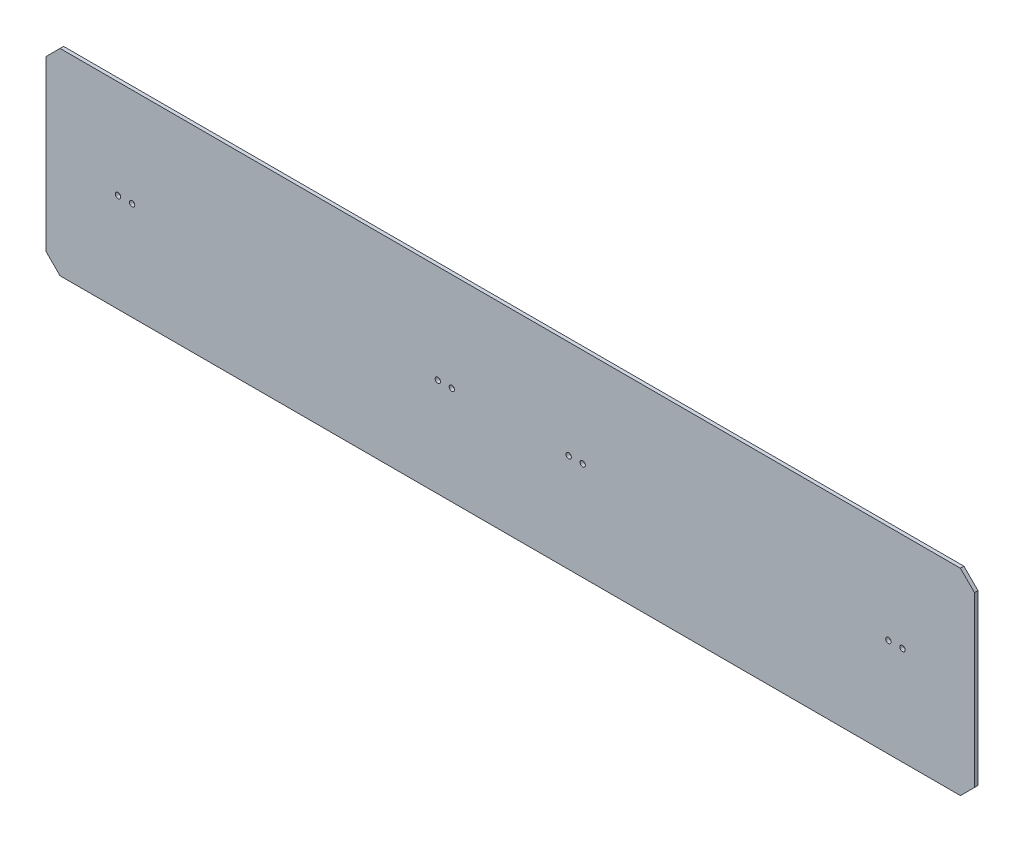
ISO-10303-21;
HEADER;
FILE_DESCRIPTION(('STEP AP214'),'2;1');
FILE_NAME('part.step','',(''),(''),'','','');
FILE_SCHEMA(('AUTOMOTIVE_DESIGN { 1 0 10303 214 1 1 1 1 }'));
ENDSEC;
DATA;
#1=APPLICATION_CONTEXT('core data for automotive mechanical design processes');
#2=APPLICATION_PROTOCOL_DEFINITION('international standard','automotive_design',2000,#1);
#3=PRODUCT_CONTEXT('',#1,'mechanical');
#4=PRODUCT('Part','Part','',(#3));
#5=PRODUCT_RELATED_PRODUCT_CATEGORY('part','',(#4));
#6=PRODUCT_DEFINITION_FORMATION('','',#4);
#7=PRODUCT_DEFINITION_CONTEXT('part definition',#1,'design');
#8=PRODUCT_DEFINITION('design','',#6,#7);
#9=PRODUCT_DEFINITION_SHAPE('','',#8);
#10=(LENGTH_UNIT() NAMED_UNIT(*) SI_UNIT(.MILLI.,.METRE.));
#11=(NAMED_UNIT(*) PLANE_ANGLE_UNIT() SI_UNIT($,.RADIAN.));
#12=(NAMED_UNIT(*) SI_UNIT($,.STERADIAN.) SOLID_ANGLE_UNIT());
#13=UNCERTAINTY_MEASURE_WITH_UNIT(LENGTH_MEASURE(1.E-05),#10,'distance_accuracy_value','');
#14=(GEOMETRIC_REPRESENTATION_CONTEXT(3) GLOBAL_UNCERTAINTY_ASSIGNED_CONTEXT((#13)) GLOBAL_UNIT_ASSIGNED_CONTEXT((#10,
#11,#12)) REPRESENTATION_CONTEXT('',''));
#15=CARTESIAN_POINT('',(0.,0.,0.));
#16=DIRECTION('',(0.,0.,1.));
#17=DIRECTION('',(1.,0.,0.));
#18=AXIS2_PLACEMENT_3D('',#15,#16,#17);
#19=CARTESIAN_POINT('',(-165.591471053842,343.129564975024,6.35));
#20=DIRECTION('',(1.,0.,0.));
#21=DIRECTION('',(0.,1.,0.));
#22=AXIS2_PLACEMENT_3D('',#19,#20,#21);
#23=PLANE('',#22);
#24=DIRECTION('',(0.,-1.,0.));
#25=VECTOR('',#24,1.);
#26=CARTESIAN_POINT('',(-165.591471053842,343.129564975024,0.));
#27=LINE('',#26,#25);
#28=CARTESIAN_POINT('',(-165.591471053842,317.729564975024,0.));
#29=VERTEX_POINT('',#28);
#30=CARTESIAN_POINT('',(-165.591471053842,12.929564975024,0.));
#31=VERTEX_POINT('',#30);
#32=EDGE_CURVE('E127',#29,#31,#27,.T.);
#33=ORIENTED_EDGE('',*,*,#32,.T.);
#34=DIRECTION('',(0.,0.,1.));
#35=VECTOR('',#34,1.);
#36=CARTESIAN_POINT('',(-165.591471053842,12.929564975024,6.35));
#37=LINE('',#36,#35);
#38=CARTESIAN_POINT('',(-165.591471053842,12.9295649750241,6.35));
#39=VERTEX_POINT('',#38);
#40=EDGE_CURVE('E11',#31,#39,#37,.T.);
#41=ORIENTED_EDGE('',*,*,#40,.T.);
#42=DIRECTION('',(0.,-1.,0.));
#43=VECTOR('',#42,1.);
#44=CARTESIAN_POINT('',(-165.591471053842,343.129564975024,6.35));
#45=LINE('',#44,#43);
#46=CARTESIAN_POINT('',(-165.591471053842,317.729564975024,6.35));
#47=VERTEX_POINT('',#46);
#48=EDGE_CURVE('E125',#47,#39,#45,.T.);
#49=ORIENTED_EDGE('',*,*,#48,.F.);
#50=DIRECTION('',(0.,0.,-1.));
#51=VECTOR('',#50,1.);
#52=CARTESIAN_POINT('',(-165.591471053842,317.729564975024,6.35));
#53=LINE('',#52,#51);
#54=EDGE_CURVE('E39',#47,#29,#53,.T.);
#55=ORIENTED_EDGE('',*,*,#54,.T.);
#56=EDGE_LOOP('',(#33,#41,#49,#55));
#57=FACE_BOUND('',#56,.T.);
#58=ADVANCED_FACE('F32',(#57),#23,.F.);
#59=CARTESIAN_POINT('',(-165.591471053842,-12.4704350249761,6.35));
#60=DIRECTION('',(0.,1.,0.));
#61=DIRECTION('',(0.,0.,1.));
#62=AXIS2_PLACEMENT_3D('',#59,#60,#61);
#63=PLANE('',#62);
#64=DIRECTION('',(1.,0.,0.));
#65=VECTOR('',#64,1.);
#66=CARTESIAN_POINT('',(-165.591471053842,-12.4704350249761,0.));
#67=LINE('',#66,#65);
#68=CARTESIAN_POINT('',(-140.191471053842,-12.4704350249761,0.));
#69=VERTEX_POINT('',#68);
#70=CARTESIAN_POINT('',(1485.40852894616,-12.4704350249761,0.));
#71=VERTEX_POINT('',#70);
#72=EDGE_CURVE('E123',#69,#71,#67,.T.);
#73=ORIENTED_EDGE('',*,*,#72,.T.);
#74=DIRECTION('',(0.,0.,1.));
#75=VECTOR('',#74,1.);
#76=CARTESIAN_POINT('',(1485.40852894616,-12.4704350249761,6.35));
#77=LINE('',#76,#75);
#78=CARTESIAN_POINT('',(1485.40852894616,-12.470435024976,6.35));
#79=VERTEX_POINT('',#78);
#80=EDGE_CURVE('E102',#71,#79,#77,.T.);
#81=ORIENTED_EDGE('',*,*,#80,.T.);
#82=DIRECTION('',(1.,0.,0.));
#83=VECTOR('',#82,1.);
#84=CARTESIAN_POINT('',(-165.591471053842,-12.4704350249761,6.35));
#85=LINE('',#84,#83);
#86=CARTESIAN_POINT('',(-140.191471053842,-12.4704350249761,6.35));
#87=VERTEX_POINT('',#86);
#88=EDGE_CURVE('E133',#87,#79,#85,.T.);
#89=ORIENTED_EDGE('',*,*,#88,.F.);
#90=DIRECTION('',(0.,0.,-1.));
#91=VECTOR('',#90,1.);
#92=CARTESIAN_POINT('',(-140.191471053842,-12.4704350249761,6.35));
#93=LINE('',#92,#91);
#94=EDGE_CURVE('E107',#87,#69,#93,.T.);
#95=ORIENTED_EDGE('',*,*,#94,.T.);
#96=EDGE_LOOP('',(#73,#81,#89,#95));
#97=FACE_BOUND('',#96,.T.);
#98=ADVANCED_FACE('F253',(#97),#63,.F.);
#99=CARTESIAN_POINT('',(1510.80852894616,343.129564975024,6.35));
#100=DIRECTION('',(-1.,0.,0.));
#101=DIRECTION('',(0.,0.,1.));
#102=AXIS2_PLACEMENT_3D('',#99,#100,#101);
#103=PLANE('',#102);
#104=DIRECTION('',(0.,1.,0.));
#105=VECTOR('',#104,1.);
#106=CARTESIAN_POINT('',(1510.80852894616,343.129564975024,6.35));
#107=LINE('',#106,#105);
#108=CARTESIAN_POINT('',(1510.80852894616,12.9295649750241,6.35));
#109=VERTEX_POINT('',#108);
#110=CARTESIAN_POINT('',(1510.80852894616,317.729564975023,6.35));
#111=VERTEX_POINT('',#110);
#112=EDGE_CURVE('E116',#109,#111,#107,.T.);
#113=ORIENTED_EDGE('',*,*,#112,.F.);
#114=DIRECTION('',(0.,0.,-1.));
#115=VECTOR('',#114,1.);
#116=CARTESIAN_POINT('',(1510.80852894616,12.9295649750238,6.35));
#117=LINE('',#116,#115);
#118=CARTESIAN_POINT('',(1510.80852894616,12.9295649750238,0.));
#119=VERTEX_POINT('',#118);
#120=EDGE_CURVE('E101',#109,#119,#117,.T.);
#121=ORIENTED_EDGE('',*,*,#120,.T.);
#122=DIRECTION('',(0.,1.,0.));
#123=VECTOR('',#122,1.);
#124=CARTESIAN_POINT('',(1510.80852894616,343.129564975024,0.));
#125=LINE('',#124,#123);
#126=CARTESIAN_POINT('',(1510.80852894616,317.729564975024,0.));
#127=VERTEX_POINT('',#126);
#128=EDGE_CURVE('E114',#119,#127,#125,.T.);
#129=ORIENTED_EDGE('',*,*,#128,.T.);
#130=DIRECTION('',(0.,0.,1.));
#131=VECTOR('',#130,1.);
#132=CARTESIAN_POINT('',(1510.80852894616,317.729564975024,6.35));
#133=LINE('',#132,#131);
#134=EDGE_CURVE('E118',#127,#111,#133,.T.);
#135=ORIENTED_EDGE('',*,*,#134,.T.);
#136=EDGE_LOOP('',(#113,#121,#129,#135));
#137=FACE_BOUND('',#136,.T.);
#138=ADVANCED_FACE('F113',(#137),#103,.F.);
#139=CARTESIAN_POINT('',(-165.591471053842,343.129564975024,6.35));
#140=DIRECTION('',(0.,-1.,0.));
#141=DIRECTION('',(1.,0.,0.));
#142=AXIS2_PLACEMENT_3D('',#139,#140,#141);
#143=PLANE('',#142);
#144=DIRECTION('',(-1.,0.,0.));
#145=VECTOR('',#144,1.);
#146=CARTESIAN_POINT('',(-165.591471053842,343.129564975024,6.35));
#147=LINE('',#146,#145);
#148=CARTESIAN_POINT('',(1485.40852894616,343.129564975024,6.35));
#149=VERTEX_POINT('',#148);
#150=CARTESIAN_POINT('',(-140.191471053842,343.129564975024,6.35));
#151=VERTEX_POINT('',#150);
#152=EDGE_CURVE('E137',#149,#151,#147,.T.);
#153=ORIENTED_EDGE('',*,*,#152,.F.);
#154=DIRECTION('',(0.,0.,-1.));
#155=VECTOR('',#154,1.);
#156=CARTESIAN_POINT('',(1485.40852894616,343.129564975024,6.35));
#157=LINE('',#156,#155);
#158=CARTESIAN_POINT('',(1485.40852894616,343.129564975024,0.));
#159=VERTEX_POINT('',#158);
#160=EDGE_CURVE('E155',#149,#159,#157,.T.);
#161=ORIENTED_EDGE('',*,*,#160,.T.);
#162=DIRECTION('',(-1.,0.,0.));
#163=VECTOR('',#162,1.);
#164=CARTESIAN_POINT('',(-165.591471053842,343.129564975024,0.));
#165=LINE('',#164,#163);
#166=CARTESIAN_POINT('',(-140.191471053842,343.129564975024,0.));
#167=VERTEX_POINT('',#166);
#168=EDGE_CURVE('E122',#159,#167,#165,.T.);
#169=ORIENTED_EDGE('',*,*,#168,.T.);
#170=DIRECTION('',(0.,0.,1.));
#171=VECTOR('',#170,1.);
#172=CARTESIAN_POINT('',(-140.191471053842,343.129564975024,6.35));
#173=LINE('',#172,#171);
#174=EDGE_CURVE('E46',#167,#151,#173,.T.);
#175=ORIENTED_EDGE('',*,*,#174,.T.);
#176=EDGE_LOOP('',(#153,#161,#169,#175));
#177=FACE_BOUND('',#176,.T.);
#178=ADVANCED_FACE('F261',(#177),#143,.F.);
#179=CARTESIAN_POINT('',(-165.591471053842,-12.4704350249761,6.35));
#180=DIRECTION('',(0.,0.,1.));
#181=DIRECTION('',(1.,0.,0.));
#182=AXIS2_PLACEMENT_3D('',#179,#180,#181);
#183=PLANE('',#182);
#184=CARTESIAN_POINT('',(-10.1434710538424,165.329564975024,6.35));
#185=DIRECTION('',(0.,0.,-1.));
#186=DIRECTION('',(-1.,0.,0.));
#187=AXIS2_PLACEMENT_3D('',#184,#185,#186);
#188=CIRCLE('',#187,4.82599999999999);
#189=CARTESIAN_POINT('',(-14.9694710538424,165.329564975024,6.35));
#190=VERTEX_POINT('',#189);
#191=EDGE_CURVE('E209',#190,#190,#188,.T.);
#192=ORIENTED_EDGE('',*,*,#191,.T.);
#193=EDGE_LOOP('',(#192));
#194=FACE_BOUND('',#193,.T.);
#195=CARTESIAN_POINT('',(-35.5434710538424,165.329564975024,6.35));
#196=DIRECTION('',(0.,0.,-1.));
#197=DIRECTION('',(-1.,0.,0.));
#198=AXIS2_PLACEMENT_3D('',#195,#196,#197);
#199=CIRCLE('',#198,4.82599999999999);
#200=CARTESIAN_POINT('',(-40.3694710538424,165.329564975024,6.35));
#201=VERTEX_POINT('',#200);
#202=EDGE_CURVE('E203',#201,#201,#199,.T.);
#203=ORIENTED_EDGE('',*,*,#202,.T.);
#204=EDGE_LOOP('',(#203));
#205=FACE_BOUND('',#204,.T.);
#206=CARTESIAN_POINT('',(541.798528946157,165.329564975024,6.35));
#207=DIRECTION('',(0.,0.,-1.));
#208=DIRECTION('',(-1.,0.,0.));
#209=AXIS2_PLACEMENT_3D('',#206,#207,#208);
#210=CIRCLE('',#209,4.82599999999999);
#211=CARTESIAN_POINT('',(536.972528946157,165.329564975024,6.35));
#212=VERTEX_POINT('',#211);
#213=EDGE_CURVE('E197',#212,#212,#210,.T.);
#214=ORIENTED_EDGE('',*,*,#213,.T.);
#215=EDGE_LOOP('',(#214));
#216=FACE_BOUND('',#215,.T.);
#217=CARTESIAN_POINT('',(567.198528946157,165.329564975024,6.35));
#218=DIRECTION('',(0.,0.,-1.));
#219=DIRECTION('',(-1.,0.,0.));
#220=AXIS2_PLACEMENT_3D('',#217,#218,#219);
#221=CIRCLE('',#220,4.82599999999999);
#222=CARTESIAN_POINT('',(562.372528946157,165.329564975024,6.35));
#223=VERTEX_POINT('',#222);
#224=EDGE_CURVE('E191',#223,#223,#221,.T.);
#225=ORIENTED_EDGE('',*,*,#224,.T.);
#226=EDGE_LOOP('',(#225));
#227=FACE_BOUND('',#226,.T.);
#228=CARTESIAN_POINT('',(778.018528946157,165.329564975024,6.35));
#229=DIRECTION('',(0.,0.,-1.));
#230=DIRECTION('',(-1.,0.,0.));
#231=AXIS2_PLACEMENT_3D('',#228,#229,#230);
#232=CIRCLE('',#231,4.82599999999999);
#233=CARTESIAN_POINT('',(773.192528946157,165.329564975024,6.35));
#234=VERTEX_POINT('',#233);
#235=EDGE_CURVE('E185',#234,#234,#232,.T.);
#236=ORIENTED_EDGE('',*,*,#235,.T.);
#237=EDGE_LOOP('',(#236));
#238=FACE_BOUND('',#237,.T.);
#239=CARTESIAN_POINT('',(803.418528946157,165.329564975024,6.35));
#240=DIRECTION('',(0.,0.,-1.));
#241=DIRECTION('',(-1.,0.,0.));
#242=AXIS2_PLACEMENT_3D('',#239,#240,#241);
#243=CIRCLE('',#242,4.82599999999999);
#244=CARTESIAN_POINT('',(798.592528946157,165.329564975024,6.35));
#245=VERTEX_POINT('',#244);
#246=EDGE_CURVE('E179',#245,#245,#243,.T.);
#247=ORIENTED_EDGE('',*,*,#246,.T.);
#248=EDGE_LOOP('',(#247));
#249=FACE_BOUND('',#248,.T.);
#250=CARTESIAN_POINT('',(1355.36052894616,165.329564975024,6.35));
#251=DIRECTION('',(0.,0.,-1.));
#252=DIRECTION('',(-1.,0.,0.));
#253=AXIS2_PLACEMENT_3D('',#250,#251,#252);
#254=CIRCLE('',#253,4.82599999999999);
#255=CARTESIAN_POINT('',(1350.53452894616,165.329564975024,6.35));
#256=VERTEX_POINT('',#255);
#257=EDGE_CURVE('E173',#256,#256,#254,.T.);
#258=ORIENTED_EDGE('',*,*,#257,.T.);
#259=EDGE_LOOP('',(#258));
#260=FACE_BOUND('',#259,.T.);
#261=CARTESIAN_POINT('',(1380.76052894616,165.329564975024,6.35));
#262=DIRECTION('',(0.,0.,-1.));
#263=DIRECTION('',(-1.,0.,0.));
#264=AXIS2_PLACEMENT_3D('',#261,#262,#263);
#265=CIRCLE('',#264,4.82599999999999);
#266=CARTESIAN_POINT('',(1375.93452894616,165.329564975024,6.35));
#267=VERTEX_POINT('',#266);
#268=EDGE_CURVE('E166',#267,#267,#265,.T.);
#269=ORIENTED_EDGE('',*,*,#268,.T.);
#270=EDGE_LOOP('',(#269));
#271=FACE_BOUND('',#270,.T.);
#272=ORIENTED_EDGE('',*,*,#88,.T.);
#273=DIRECTION('',(-0.707106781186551,-0.707106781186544,0.));
#274=VECTOR('',#273,1.);
#275=CARTESIAN_POINT('',(659.90852894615,-837.970435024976,6.35));
#276=LINE('',#275,#274);
#277=EDGE_CURVE('E152',#79,#109,#276,.F.);
#278=ORIENTED_EDGE('',*,*,#277,.T.);
#279=ORIENTED_EDGE('',*,*,#112,.T.);
#280=DIRECTION('',(0.707106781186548,-0.707106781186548,0.));
#281=VECTOR('',#280,1.);
#282=CARTESIAN_POINT('',(837.708528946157,990.829564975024,6.35));
#283=LINE('',#282,#281);
#284=EDGE_CURVE('E53',#111,#149,#283,.F.);
#285=ORIENTED_EDGE('',*,*,#284,.T.);
#286=ORIENTED_EDGE('',*,*,#152,.T.);
#287=DIRECTION('',(0.707106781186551,0.707106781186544,0.));
#288=VECTOR('',#287,1.);
#289=CARTESIAN_POINT('',(-330.691471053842,152.629564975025,6.35));
#290=LINE('',#289,#288);
#291=EDGE_CURVE('E147',#151,#47,#290,.F.);
#292=ORIENTED_EDGE('',*,*,#291,.T.);
#293=ORIENTED_EDGE('',*,*,#48,.T.);
#294=DIRECTION('',(-0.707106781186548,0.707106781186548,0.));
#295=VECTOR('',#294,1.);
#296=CARTESIAN_POINT('',(-152.891471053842,0.229564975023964,6.35));
#297=LINE('',#296,#295);
#298=EDGE_CURVE('E149',#39,#87,#297,.F.);
#299=ORIENTED_EDGE('',*,*,#298,.T.);
#300=EDGE_LOOP('',(#272,#278,#279,#285,#286,#292,#293,#299));
#301=FACE_BOUND('',#300,.T.);
#302=ADVANCED_FACE('F220',(#194,#205,#216,#227,#238,#249,#260,#271,#301),#183,.T.);
#303=CARTESIAN_POINT('',(-165.591471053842,-12.4704350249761,0.));
#304=DIRECTION('',(0.,0.,1.));
#305=DIRECTION('',(1.,0.,0.));
#306=AXIS2_PLACEMENT_3D('',#303,#304,#305);
#307=PLANE('',#306);
#308=CARTESIAN_POINT('',(-10.1434710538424,165.329564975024,0.));
#309=DIRECTION('',(0.,0.,-1.));
#310=DIRECTION('',(-1.,0.,0.));
#311=AXIS2_PLACEMENT_3D('',#308,#309,#310);
#312=CIRCLE('',#311,4.82599999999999);
#313=CARTESIAN_POINT('',(-14.9694710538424,165.329564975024,0.));
#314=VERTEX_POINT('',#313);
#315=EDGE_CURVE('E212',#314,#314,#312,.T.);
#316=ORIENTED_EDGE('',*,*,#315,.F.);
#317=EDGE_LOOP('',(#316));
#318=FACE_BOUND('',#317,.T.);
#319=CARTESIAN_POINT('',(-35.5434710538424,165.329564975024,0.));
#320=DIRECTION('',(0.,0.,-1.));
#321=DIRECTION('',(-1.,0.,0.));
#322=AXIS2_PLACEMENT_3D('',#319,#320,#321);
#323=CIRCLE('',#322,4.82599999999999);
#324=CARTESIAN_POINT('',(-40.3694710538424,165.329564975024,0.));
#325=VERTEX_POINT('',#324);
#326=EDGE_CURVE('E206',#325,#325,#323,.T.);
#327=ORIENTED_EDGE('',*,*,#326,.F.);
#328=EDGE_LOOP('',(#327));
#329=FACE_BOUND('',#328,.T.);
#330=CARTESIAN_POINT('',(541.798528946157,165.329564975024,0.));
#331=DIRECTION('',(0.,0.,-1.));
#332=DIRECTION('',(-1.,0.,0.));
#333=AXIS2_PLACEMENT_3D('',#330,#331,#332);
#334=CIRCLE('',#333,4.82599999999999);
#335=CARTESIAN_POINT('',(536.972528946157,165.329564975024,0.));
#336=VERTEX_POINT('',#335);
#337=EDGE_CURVE('E200',#336,#336,#334,.T.);
#338=ORIENTED_EDGE('',*,*,#337,.F.);
#339=EDGE_LOOP('',(#338));
#340=FACE_BOUND('',#339,.T.);
#341=CARTESIAN_POINT('',(567.198528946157,165.329564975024,0.));
#342=DIRECTION('',(0.,0.,-1.));
#343=DIRECTION('',(-1.,0.,0.));
#344=AXIS2_PLACEMENT_3D('',#341,#342,#343);
#345=CIRCLE('',#344,4.82599999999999);
#346=CARTESIAN_POINT('',(562.372528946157,165.329564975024,0.));
#347=VERTEX_POINT('',#346);
#348=EDGE_CURVE('E194',#347,#347,#345,.T.);
#349=ORIENTED_EDGE('',*,*,#348,.F.);
#350=EDGE_LOOP('',(#349));
#351=FACE_BOUND('',#350,.T.);
#352=CARTESIAN_POINT('',(778.018528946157,165.329564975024,0.));
#353=DIRECTION('',(0.,0.,-1.));
#354=DIRECTION('',(-1.,0.,0.));
#355=AXIS2_PLACEMENT_3D('',#352,#353,#354);
#356=CIRCLE('',#355,4.82599999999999);
#357=CARTESIAN_POINT('',(773.192528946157,165.329564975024,0.));
#358=VERTEX_POINT('',#357);
#359=EDGE_CURVE('E188',#358,#358,#356,.T.);
#360=ORIENTED_EDGE('',*,*,#359,.F.);
#361=EDGE_LOOP('',(#360));
#362=FACE_BOUND('',#361,.T.);
#363=CARTESIAN_POINT('',(803.418528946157,165.329564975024,0.));
#364=DIRECTION('',(0.,0.,-1.));
#365=DIRECTION('',(-1.,0.,0.));
#366=AXIS2_PLACEMENT_3D('',#363,#364,#365);
#367=CIRCLE('',#366,4.82599999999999);
#368=CARTESIAN_POINT('',(798.592528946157,165.329564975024,0.));
#369=VERTEX_POINT('',#368);
#370=EDGE_CURVE('E182',#369,#369,#367,.T.);
#371=ORIENTED_EDGE('',*,*,#370,.F.);
#372=EDGE_LOOP('',(#371));
#373=FACE_BOUND('',#372,.T.);
#374=CARTESIAN_POINT('',(1355.36052894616,165.329564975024,0.));
#375=DIRECTION('',(0.,0.,-1.));
#376=DIRECTION('',(-1.,0.,0.));
#377=AXIS2_PLACEMENT_3D('',#374,#375,#376);
#378=CIRCLE('',#377,4.82599999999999);
#379=CARTESIAN_POINT('',(1350.53452894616,165.329564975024,0.));
#380=VERTEX_POINT('',#379);
#381=EDGE_CURVE('E176',#380,#380,#378,.T.);
#382=ORIENTED_EDGE('',*,*,#381,.F.);
#383=EDGE_LOOP('',(#382));
#384=FACE_BOUND('',#383,.T.);
#385=CARTESIAN_POINT('',(1380.76052894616,165.329564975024,0.));
#386=DIRECTION('',(0.,0.,-1.));
#387=DIRECTION('',(-1.,0.,0.));
#388=AXIS2_PLACEMENT_3D('',#385,#386,#387);
#389=CIRCLE('',#388,4.82599999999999);
#390=CARTESIAN_POINT('',(1375.93452894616,165.329564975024,0.));
#391=VERTEX_POINT('',#390);
#392=EDGE_CURVE('E168',#391,#391,#389,.T.);
#393=ORIENTED_EDGE('',*,*,#392,.F.);
#394=EDGE_LOOP('',(#393));
#395=FACE_BOUND('',#394,.T.);
#396=ORIENTED_EDGE('',*,*,#128,.F.);
#397=DIRECTION('',(0.707106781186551,0.707106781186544,0.));
#398=VECTOR('',#397,1.);
#399=CARTESIAN_POINT('',(1510.80852894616,12.9295649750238,0.));
#400=LINE('',#399,#398);
#401=EDGE_CURVE('E97',#119,#71,#400,.F.);
#402=ORIENTED_EDGE('',*,*,#401,.T.);
#403=ORIENTED_EDGE('',*,*,#72,.F.);
#404=DIRECTION('',(0.707106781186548,-0.707106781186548,0.));
#405=VECTOR('',#404,1.);
#406=CARTESIAN_POINT('',(-140.191471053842,-12.4704350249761,0.));
#407=LINE('',#406,#405);
#408=EDGE_CURVE('E141',#69,#31,#407,.F.);
#409=ORIENTED_EDGE('',*,*,#408,.T.);
#410=ORIENTED_EDGE('',*,*,#32,.F.);
#411=DIRECTION('',(-0.707106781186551,-0.707106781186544,0.));
#412=VECTOR('',#411,1.);
#413=CARTESIAN_POINT('',(-165.591471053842,317.729564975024,0.));
#414=LINE('',#413,#412);
#415=EDGE_CURVE('E117',#29,#167,#414,.F.);
#416=ORIENTED_EDGE('',*,*,#415,.T.);
#417=ORIENTED_EDGE('',*,*,#168,.F.);
#418=DIRECTION('',(-0.707106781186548,0.707106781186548,0.));
#419=VECTOR('',#418,1.);
#420=CARTESIAN_POINT('',(1485.40852894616,343.129564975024,0.));
#421=LINE('',#420,#419);
#422=EDGE_CURVE('E108',#159,#127,#421,.F.);
#423=ORIENTED_EDGE('',*,*,#422,.T.);
#424=EDGE_LOOP('',(#396,#402,#403,#409,#410,#416,#417,#423));
#425=FACE_BOUND('',#424,.T.);
#426=ADVANCED_FACE('F120',(#318,#329,#340,#351,#362,#373,#384,#395,#425),#307,.F.);
#427=CARTESIAN_POINT('',(1510.80852894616,12.9295649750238,6.35));
#428=DIRECTION('',(-0.707106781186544,0.707106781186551,0.));
#429=DIRECTION('',(-0.707106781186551,-0.707106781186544,0.));
#430=AXIS2_PLACEMENT_3D('',#427,#428,#429);
#431=PLANE('',#430);
#432=ORIENTED_EDGE('',*,*,#277,.F.);
#433=ORIENTED_EDGE('',*,*,#80,.F.);
#434=ORIENTED_EDGE('',*,*,#401,.F.);
#435=ORIENTED_EDGE('',*,*,#120,.F.);
#436=EDGE_LOOP('',(#432,#433,#434,#435));
#437=FACE_BOUND('',#436,.T.);
#438=ADVANCED_FACE('F100',(#437),#431,.F.);
#439=CARTESIAN_POINT('',(1485.40852894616,343.129564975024,6.35));
#440=DIRECTION('',(-0.707106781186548,-0.707106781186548,0.));
#441=DIRECTION('',(0.707106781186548,-0.707106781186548,0.));
#442=AXIS2_PLACEMENT_3D('',#439,#440,#441);
#443=PLANE('',#442);
#444=ORIENTED_EDGE('',*,*,#284,.F.);
#445=ORIENTED_EDGE('',*,*,#134,.F.);
#446=ORIENTED_EDGE('',*,*,#422,.F.);
#447=ORIENTED_EDGE('',*,*,#160,.F.);
#448=EDGE_LOOP('',(#444,#445,#446,#447));
#449=FACE_BOUND('',#448,.T.);
#450=ADVANCED_FACE('F271',(#449),#443,.F.);
#451=CARTESIAN_POINT('',(-140.191471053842,-12.4704350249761,6.35));
#452=DIRECTION('',(0.707106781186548,0.707106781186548,0.));
#453=DIRECTION('',(-0.707106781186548,0.707106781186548,0.));
#454=AXIS2_PLACEMENT_3D('',#451,#452,#453);
#455=PLANE('',#454);
#456=ORIENTED_EDGE('',*,*,#298,.F.);
#457=ORIENTED_EDGE('',*,*,#40,.F.);
#458=ORIENTED_EDGE('',*,*,#408,.F.);
#459=ORIENTED_EDGE('',*,*,#94,.F.);
#460=EDGE_LOOP('',(#456,#457,#458,#459));
#461=FACE_BOUND('',#460,.T.);
#462=ADVANCED_FACE('F249',(#461),#455,.F.);
#463=CARTESIAN_POINT('',(-165.591471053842,317.729564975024,6.35));
#464=DIRECTION('',(0.707106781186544,-0.707106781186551,0.));
#465=DIRECTION('',(0.707106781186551,0.707106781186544,0.));
#466=AXIS2_PLACEMENT_3D('',#463,#464,#465);
#467=PLANE('',#466);
#468=ORIENTED_EDGE('',*,*,#291,.F.);
#469=ORIENTED_EDGE('',*,*,#174,.F.);
#470=ORIENTED_EDGE('',*,*,#415,.F.);
#471=ORIENTED_EDGE('',*,*,#54,.F.);
#472=EDGE_LOOP('',(#468,#469,#470,#471));
#473=FACE_BOUND('',#472,.T.);
#474=ADVANCED_FACE('F239',(#473),#467,.F.);
#475=CARTESIAN_POINT('',(1380.76052894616,165.329564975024,6.35));
#476=DIRECTION('',(0.,0.,-1.));
#477=DIRECTION('',(-1.,0.,0.));
#478=AXIS2_PLACEMENT_3D('',#475,#476,#477);
#479=CYLINDRICAL_SURFACE('',#478,4.82599999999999);
#480=ORIENTED_EDGE('',*,*,#268,.F.);
#481=EDGE_LOOP('',(#480));
#482=FACE_BOUND('',#481,.T.);
#483=ORIENTED_EDGE('',*,*,#392,.T.);
#484=EDGE_LOOP('',(#483));
#485=FACE_BOUND('',#484,.T.);
#486=ADVANCED_FACE('F236',(#482,#485),#479,.F.);
#487=CARTESIAN_POINT('',(1355.36052894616,165.329564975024,6.35));
#488=DIRECTION('',(0.,0.,-1.));
#489=DIRECTION('',(-1.,0.,0.));
#490=AXIS2_PLACEMENT_3D('',#487,#488,#489);
#491=CYLINDRICAL_SURFACE('',#490,4.82599999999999);
#492=ORIENTED_EDGE('',*,*,#257,.F.);
#493=EDGE_LOOP('',(#492));
#494=FACE_BOUND('',#493,.T.);
#495=ORIENTED_EDGE('',*,*,#381,.T.);
#496=EDGE_LOOP('',(#495));
#497=FACE_BOUND('',#496,.T.);
#498=ADVANCED_FACE('F238',(#494,#497),#491,.F.);
#499=CARTESIAN_POINT('',(803.418528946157,165.329564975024,6.35));
#500=DIRECTION('',(0.,0.,-1.));
#501=DIRECTION('',(-1.,0.,0.));
#502=AXIS2_PLACEMENT_3D('',#499,#500,#501);
#503=CYLINDRICAL_SURFACE('',#502,4.82599999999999);
#504=ORIENTED_EDGE('',*,*,#246,.F.);
#505=EDGE_LOOP('',(#504));
#506=FACE_BOUND('',#505,.T.);
#507=ORIENTED_EDGE('',*,*,#370,.T.);
#508=EDGE_LOOP('',(#507));
#509=FACE_BOUND('',#508,.T.);
#510=ADVANCED_FACE('F246',(#506,#509),#503,.F.);
#511=CARTESIAN_POINT('',(778.018528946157,165.329564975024,6.35));
#512=DIRECTION('',(0.,0.,-1.));
#513=DIRECTION('',(-1.,0.,0.));
#514=AXIS2_PLACEMENT_3D('',#511,#512,#513);
#515=CYLINDRICAL_SURFACE('',#514,4.82599999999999);
#516=ORIENTED_EDGE('',*,*,#235,.F.);
#517=EDGE_LOOP('',(#516));
#518=FACE_BOUND('',#517,.T.);
#519=ORIENTED_EDGE('',*,*,#359,.T.);
#520=EDGE_LOOP('',(#519));
#521=FACE_BOUND('',#520,.T.);
#522=ADVANCED_FACE('F322',(#518,#521),#515,.F.);
#523=CARTESIAN_POINT('',(567.198528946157,165.329564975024,6.35));
#524=DIRECTION('',(0.,0.,-1.));
#525=DIRECTION('',(-1.,0.,0.));
#526=AXIS2_PLACEMENT_3D('',#523,#524,#525);
#527=CYLINDRICAL_SURFACE('',#526,4.82599999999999);
#528=ORIENTED_EDGE('',*,*,#224,.F.);
#529=EDGE_LOOP('',(#528));
#530=FACE_BOUND('',#529,.T.);
#531=ORIENTED_EDGE('',*,*,#348,.T.);
#532=EDGE_LOOP('',(#531));
#533=FACE_BOUND('',#532,.T.);
#534=ADVANCED_FACE('F332',(#530,#533),#527,.F.);
#535=CARTESIAN_POINT('',(541.798528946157,165.329564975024,6.35));
#536=DIRECTION('',(0.,0.,-1.));
#537=DIRECTION('',(-1.,0.,0.));
#538=AXIS2_PLACEMENT_3D('',#535,#536,#537);
#539=CYLINDRICAL_SURFACE('',#538,4.82599999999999);
#540=ORIENTED_EDGE('',*,*,#213,.F.);
#541=EDGE_LOOP('',(#540));
#542=FACE_BOUND('',#541,.T.);
#543=ORIENTED_EDGE('',*,*,#337,.T.);
#544=EDGE_LOOP('',(#543));
#545=FACE_BOUND('',#544,.T.);
#546=ADVANCED_FACE('F342',(#542,#545),#539,.F.);
#547=CARTESIAN_POINT('',(-35.5434710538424,165.329564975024,6.35));
#548=DIRECTION('',(0.,0.,-1.));
#549=DIRECTION('',(-1.,0.,0.));
#550=AXIS2_PLACEMENT_3D('',#547,#548,#549);
#551=CYLINDRICAL_SURFACE('',#550,4.82599999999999);
#552=ORIENTED_EDGE('',*,*,#202,.F.);
#553=EDGE_LOOP('',(#552));
#554=FACE_BOUND('',#553,.T.);
#555=ORIENTED_EDGE('',*,*,#326,.T.);
#556=EDGE_LOOP('',(#555));
#557=FACE_BOUND('',#556,.T.);
#558=ADVANCED_FACE('F352',(#554,#557),#551,.F.);
#559=CARTESIAN_POINT('',(-10.1434710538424,165.329564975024,6.35));
#560=DIRECTION('',(0.,0.,-1.));
#561=DIRECTION('',(-1.,0.,0.));
#562=AXIS2_PLACEMENT_3D('',#559,#560,#561);
#563=CYLINDRICAL_SURFACE('',#562,4.82599999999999);
#564=ORIENTED_EDGE('',*,*,#191,.F.);
#565=EDGE_LOOP('',(#564));
#566=FACE_BOUND('',#565,.T.);
#567=ORIENTED_EDGE('',*,*,#315,.T.);
#568=EDGE_LOOP('',(#567));
#569=FACE_BOUND('',#568,.T.);
#570=ADVANCED_FACE('F216',(#566,#569),#563,.F.);
#571=CLOSED_SHELL('',(#58,#98,#138,#178,#302,#426,#438,#450,#462,#474,#486,#498,#510,#522,#534,
#546,#558,#570));
#572=MANIFOLD_SOLID_BREP('B2',#571);
#573=ADVANCED_BREP_SHAPE_REPRESENTATION('',(#18,#572),#14);
#574=SHAPE_DEFINITION_REPRESENTATION(#9,#573);
ENDSEC;
END-ISO-10303-21;
